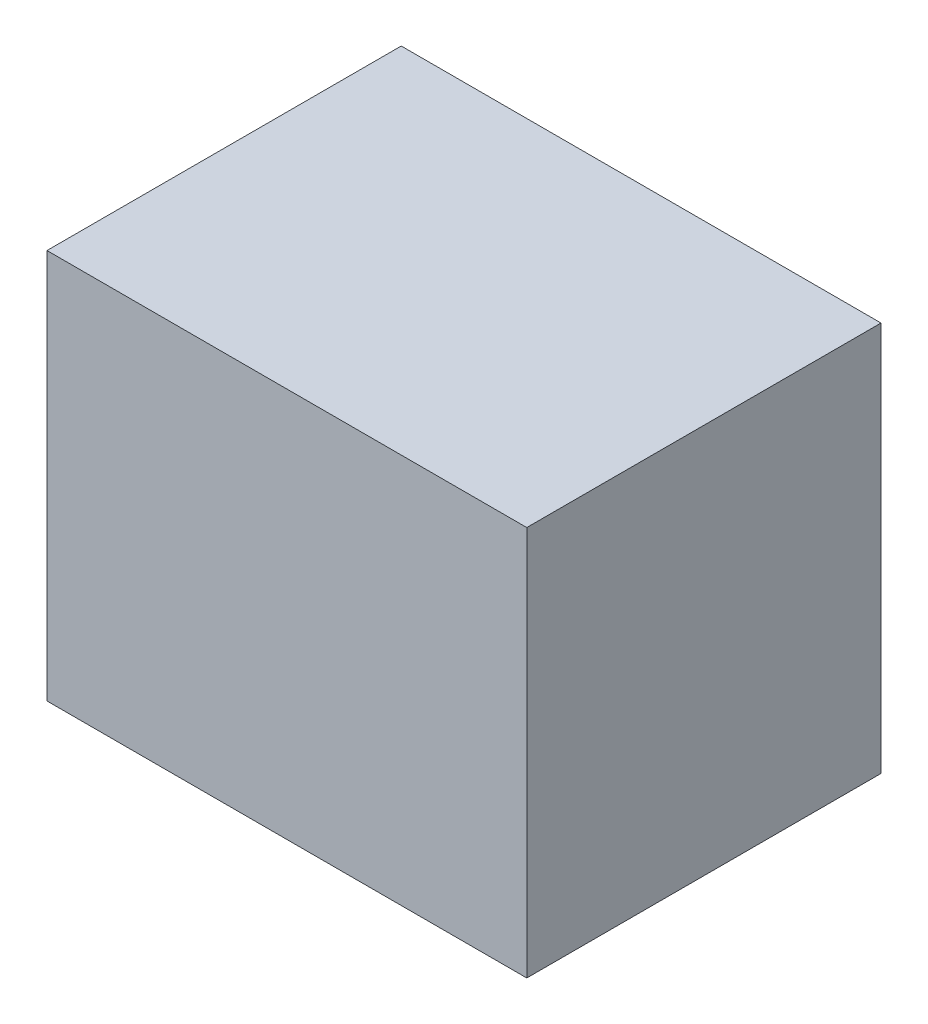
ISO-10303-21;
HEADER;
FILE_DESCRIPTION(('STEP AP214'),'2;1');
FILE_NAME('part.step','',(''),(''),'','','');
FILE_SCHEMA(('AUTOMOTIVE_DESIGN { 1 0 10303 214 1 1 1 1 }'));
ENDSEC;
DATA;
#1=APPLICATION_CONTEXT('core data for automotive mechanical design processes');
#2=APPLICATION_PROTOCOL_DEFINITION('international standard','automotive_design',2000,#1);
#3=PRODUCT_CONTEXT('',#1,'mechanical');
#4=PRODUCT('Part','Part','',(#3));
#5=PRODUCT_RELATED_PRODUCT_CATEGORY('part','',(#4));
#6=PRODUCT_DEFINITION_FORMATION('','',#4);
#7=PRODUCT_DEFINITION_CONTEXT('part definition',#1,'design');
#8=PRODUCT_DEFINITION('design','',#6,#7);
#9=PRODUCT_DEFINITION_SHAPE('','',#8);
#10=(LENGTH_UNIT() NAMED_UNIT(*) SI_UNIT(.MILLI.,.METRE.));
#11=(NAMED_UNIT(*) PLANE_ANGLE_UNIT() SI_UNIT($,.RADIAN.));
#12=(NAMED_UNIT(*) SI_UNIT($,.STERADIAN.) SOLID_ANGLE_UNIT());
#13=UNCERTAINTY_MEASURE_WITH_UNIT(LENGTH_MEASURE(1.E-05),#10,'distance_accuracy_value','');
#14=(GEOMETRIC_REPRESENTATION_CONTEXT(3) GLOBAL_UNCERTAINTY_ASSIGNED_CONTEXT((#13)) GLOBAL_UNIT_ASSIGNED_CONTEXT((#10,
#11,#12)) REPRESENTATION_CONTEXT('',''));
#15=CARTESIAN_POINT('',(0.,0.,0.));
#16=DIRECTION('',(0.,0.,1.));
#17=DIRECTION('',(1.,0.,0.));
#18=AXIS2_PLACEMENT_3D('',#15,#16,#17);
#19=CARTESIAN_POINT('',(53.5,-43.5,79.));
#20=DIRECTION('',(-1.,0.,0.));
#21=DIRECTION('',(0.,0.,1.));
#22=AXIS2_PLACEMENT_3D('',#19,#20,#21);
#23=PLANE('',#22);
#24=DIRECTION('',(0.,1.,0.));
#25=VECTOR('',#24,1.);
#26=CARTESIAN_POINT('',(53.5,-43.5,0.));
#27=LINE('',#26,#25);
#28=CARTESIAN_POINT('',(53.5,-43.5,0.));
#29=VERTEX_POINT('',#28);
#30=CARTESIAN_POINT('',(53.5,43.5,0.));
#31=VERTEX_POINT('',#30);
#32=EDGE_CURVE('E147',#29,#31,#27,.T.);
#33=ORIENTED_EDGE('',*,*,#32,.T.);
#34=DIRECTION('',(0.,0.,-1.));
#35=VECTOR('',#34,1.);
#36=CARTESIAN_POINT('',(53.5,43.5,79.));
#37=LINE('',#36,#35);
#38=CARTESIAN_POINT('',(53.5,43.5,79.));
#39=VERTEX_POINT('',#38);
#40=EDGE_CURVE('E11',#39,#31,#37,.T.);
#41=ORIENTED_EDGE('',*,*,#40,.F.);
#42=DIRECTION('',(0.,1.,0.));
#43=VECTOR('',#42,1.);
#44=CARTESIAN_POINT('',(53.5,-43.5,79.));
#45=LINE('',#44,#43);
#46=CARTESIAN_POINT('',(53.5,-43.5,79.));
#47=VERTEX_POINT('',#46);
#48=EDGE_CURVE('E158',#47,#39,#45,.T.);
#49=ORIENTED_EDGE('',*,*,#48,.F.);
#50=DIRECTION('',(0.,0.,-1.));
#51=VECTOR('',#50,1.);
#52=CARTESIAN_POINT('',(53.5,-43.5,79.));
#53=LINE('',#52,#51);
#54=EDGE_CURVE('E167',#47,#29,#53,.T.);
#55=ORIENTED_EDGE('',*,*,#54,.T.);
#56=EDGE_LOOP('',(#33,#41,#49,#55));
#57=FACE_BOUND('',#56,.T.);
#58=ADVANCED_FACE('F45',(#57),#23,.F.);
#59=CARTESIAN_POINT('',(-53.5,43.5,79.));
#60=DIRECTION('',(0.,-1.,0.));
#61=DIRECTION('',(0.,0.,-1.));
#62=AXIS2_PLACEMENT_3D('',#59,#60,#61);
#63=PLANE('',#62);
#64=DIRECTION('',(-1.,0.,0.));
#65=VECTOR('',#64,1.);
#66=CARTESIAN_POINT('',(-53.5,43.5,0.));
#67=LINE('',#66,#65);
#68=CARTESIAN_POINT('',(-53.5,43.5,0.));
#69=VERTEX_POINT('',#68);
#70=EDGE_CURVE('E152',#31,#69,#67,.T.);
#71=ORIENTED_EDGE('',*,*,#70,.T.);
#72=DIRECTION('',(0.,0.,-1.));
#73=VECTOR('',#72,1.);
#74=CARTESIAN_POINT('',(-53.5,43.5,79.));
#75=LINE('',#74,#73);
#76=CARTESIAN_POINT('',(-53.5,43.5,79.));
#77=VERTEX_POINT('',#76);
#78=EDGE_CURVE('E54',#77,#69,#75,.T.);
#79=ORIENTED_EDGE('',*,*,#78,.F.);
#80=DIRECTION('',(-1.,0.,0.));
#81=VECTOR('',#80,1.);
#82=CARTESIAN_POINT('',(-53.5,43.5,79.));
#83=LINE('',#82,#81);
#84=EDGE_CURVE('E99',#39,#77,#83,.T.);
#85=ORIENTED_EDGE('',*,*,#84,.F.);
#86=ORIENTED_EDGE('',*,*,#40,.T.);
#87=EDGE_LOOP('',(#71,#79,#85,#86));
#88=FACE_BOUND('',#87,.T.);
#89=ADVANCED_FACE('F224',(#88),#63,.F.);
#90=CARTESIAN_POINT('',(-53.5,-43.5,79.));
#91=DIRECTION('',(1.,0.,0.));
#92=DIRECTION('',(0.,0.,-1.));
#93=AXIS2_PLACEMENT_3D('',#90,#91,#92);
#94=PLANE('',#93);
#95=DIRECTION('',(0.,-1.,0.));
#96=VECTOR('',#95,1.);
#97=CARTESIAN_POINT('',(-53.5,-43.5,0.));
#98=LINE('',#97,#96);
#99=CARTESIAN_POINT('',(-53.5,-43.5,0.));
#100=VERTEX_POINT('',#99);
#101=EDGE_CURVE('E171',#69,#100,#98,.T.);
#102=ORIENTED_EDGE('',*,*,#101,.T.);
#103=DIRECTION('',(0.,0.,-1.));
#104=VECTOR('',#103,1.);
#105=CARTESIAN_POINT('',(-53.5,-43.5,79.));
#106=LINE('',#105,#104);
#107=CARTESIAN_POINT('',(-53.5,-43.5,79.));
#108=VERTEX_POINT('',#107);
#109=EDGE_CURVE('E178',#108,#100,#106,.T.);
#110=ORIENTED_EDGE('',*,*,#109,.F.);
#111=DIRECTION('',(0.,-1.,0.));
#112=VECTOR('',#111,1.);
#113=CARTESIAN_POINT('',(-53.5,-43.5,79.));
#114=LINE('',#113,#112);
#115=EDGE_CURVE('E163',#77,#108,#114,.T.);
#116=ORIENTED_EDGE('',*,*,#115,.F.);
#117=ORIENTED_EDGE('',*,*,#78,.T.);
#118=EDGE_LOOP('',(#102,#110,#116,#117));
#119=FACE_BOUND('',#118,.T.);
#120=ADVANCED_FACE('F229',(#119),#94,.F.);
#121=CARTESIAN_POINT('',(-53.5,-43.5,79.));
#122=DIRECTION('',(0.,1.,0.));
#123=DIRECTION('',(0.,0.,1.));
#124=AXIS2_PLACEMENT_3D('',#121,#122,#123);
#125=PLANE('',#124);
#126=DIRECTION('',(1.,0.,0.));
#127=VECTOR('',#126,1.);
#128=CARTESIAN_POINT('',(-53.5,-43.5,0.));
#129=LINE('',#128,#127);
#130=EDGE_CURVE('E92',#100,#29,#129,.T.);
#131=ORIENTED_EDGE('',*,*,#130,.T.);
#132=ORIENTED_EDGE('',*,*,#54,.F.);
#133=DIRECTION('',(1.,0.,0.));
#134=VECTOR('',#133,1.);
#135=CARTESIAN_POINT('',(-53.5,-43.5,79.));
#136=LINE('',#135,#134);
#137=EDGE_CURVE('E71',#108,#47,#136,.T.);
#138=ORIENTED_EDGE('',*,*,#137,.F.);
#139=ORIENTED_EDGE('',*,*,#109,.T.);
#140=EDGE_LOOP('',(#131,#132,#138,#139));
#141=FACE_BOUND('',#140,.T.);
#142=ADVANCED_FACE('F238',(#141),#125,.F.);
#143=CARTESIAN_POINT('',(0.,0.,79.));
#144=DIRECTION('',(0.,0.,-1.));
#145=DIRECTION('',(-1.,0.,0.));
#146=AXIS2_PLACEMENT_3D('',#143,#144,#145);
#147=PLANE('',#146);
#148=ORIENTED_EDGE('',*,*,#48,.T.);
#149=ORIENTED_EDGE('',*,*,#84,.T.);
#150=ORIENTED_EDGE('',*,*,#115,.T.);
#151=ORIENTED_EDGE('',*,*,#137,.T.);
#152=EDGE_LOOP('',(#148,#149,#150,#151));
#153=FACE_BOUND('',#152,.T.);
#154=ADVANCED_FACE('F203',(#153),#147,.F.);
#155=CARTESIAN_POINT('',(0.,0.,0.));
#156=DIRECTION('',(0.,0.,-1.));
#157=DIRECTION('',(-1.,0.,0.));
#158=AXIS2_PLACEMENT_3D('',#155,#156,#157);
#159=PLANE('',#158);
#160=CARTESIAN_POINT('',(-48.7,38.7,0.));
#161=DIRECTION('',(0.,0.,-1.));
#162=DIRECTION('',(-1.,0.,0.));
#163=AXIS2_PLACEMENT_3D('',#160,#161,#162);
#164=CIRCLE('',#163,1.5);
#165=CARTESIAN_POINT('',(-50.2,38.7,0.));
#166=VERTEX_POINT('',#165);
#167=EDGE_CURVE('E48',#166,#166,#164,.T.);
#168=ORIENTED_EDGE('',*,*,#167,.F.);
#169=EDGE_LOOP('',(#168));
#170=FACE_BOUND('',#169,.T.);
#171=CARTESIAN_POINT('',(-48.7,-38.5,0.));
#172=DIRECTION('',(0.,0.,-1.));
#173=DIRECTION('',(-1.,0.,0.));
#174=AXIS2_PLACEMENT_3D('',#171,#172,#173);
#175=CIRCLE('',#174,1.5);
#176=CARTESIAN_POINT('',(-50.2,-38.5,0.));
#177=VERTEX_POINT('',#176);
#178=EDGE_CURVE('E190',#177,#177,#175,.T.);
#179=ORIENTED_EDGE('',*,*,#178,.F.);
#180=EDGE_LOOP('',(#179));
#181=FACE_BOUND('',#180,.T.);
#182=CARTESIAN_POINT('',(48.5,38.7,0.));
#183=DIRECTION('',(0.,0.,-1.));
#184=DIRECTION('',(-1.,0.,0.));
#185=AXIS2_PLACEMENT_3D('',#182,#183,#184);
#186=CIRCLE('',#185,1.5);
#187=CARTESIAN_POINT('',(47.,38.7,0.));
#188=VERTEX_POINT('',#187);
#189=EDGE_CURVE('E187',#188,#188,#186,.T.);
#190=ORIENTED_EDGE('',*,*,#189,.F.);
#191=EDGE_LOOP('',(#190));
#192=FACE_BOUND('',#191,.T.);
#193=CARTESIAN_POINT('',(48.5,-38.5,0.));
#194=DIRECTION('',(0.,0.,-1.));
#195=DIRECTION('',(-1.,0.,0.));
#196=AXIS2_PLACEMENT_3D('',#193,#194,#195);
#197=CIRCLE('',#196,1.5);
#198=CARTESIAN_POINT('',(47.,-38.5,0.));
#199=VERTEX_POINT('',#198);
#200=EDGE_CURVE('E140',#199,#199,#197,.T.);
#201=ORIENTED_EDGE('',*,*,#200,.F.);
#202=EDGE_LOOP('',(#201));
#203=FACE_BOUND('',#202,.T.);
#204=DIRECTION('',(-1.,0.,0.));
#205=VECTOR('',#204,1.);
#206=CARTESIAN_POINT('',(-46.5,37.5,0.));
#207=LINE('',#206,#205);
#208=CARTESIAN_POINT('',(46.5,37.5,0.));
#209=VERTEX_POINT('',#208);
#210=CARTESIAN_POINT('',(-46.5,37.5,0.));
#211=VERTEX_POINT('',#210);
#212=EDGE_CURVE('E145',#209,#211,#207,.T.);
#213=ORIENTED_EDGE('',*,*,#212,.T.);
#214=DIRECTION('',(0.,-1.,0.));
#215=VECTOR('',#214,1.);
#216=CARTESIAN_POINT('',(-46.5,37.5,0.));
#217=LINE('',#216,#215);
#218=CARTESIAN_POINT('',(-46.5,-37.5,0.));
#219=VERTEX_POINT('',#218);
#220=EDGE_CURVE('E126',#211,#219,#217,.T.);
#221=ORIENTED_EDGE('',*,*,#220,.T.);
#222=DIRECTION('',(-1.,0.,0.));
#223=VECTOR('',#222,1.);
#224=CARTESIAN_POINT('',(-46.5,-37.5,0.));
#225=LINE('',#224,#223);
#226=CARTESIAN_POINT('',(46.5,-37.5,0.));
#227=VERTEX_POINT('',#226);
#228=EDGE_CURVE('E133',#227,#219,#225,.T.);
#229=ORIENTED_EDGE('',*,*,#228,.F.);
#230=DIRECTION('',(0.,-1.,0.));
#231=VECTOR('',#230,1.);
#232=CARTESIAN_POINT('',(46.5,37.5,0.));
#233=LINE('',#232,#231);
#234=EDGE_CURVE('E344',#209,#227,#233,.T.);
#235=ORIENTED_EDGE('',*,*,#234,.F.);
#236=EDGE_LOOP('',(#213,#221,#229,#235));
#237=FACE_BOUND('',#236,.T.);
#238=ORIENTED_EDGE('',*,*,#32,.F.);
#239=ORIENTED_EDGE('',*,*,#130,.F.);
#240=ORIENTED_EDGE('',*,*,#101,.F.);
#241=ORIENTED_EDGE('',*,*,#70,.F.);
#242=EDGE_LOOP('',(#238,#239,#240,#241));
#243=FACE_BOUND('',#242,.T.);
#244=ADVANCED_FACE('F142',(#170,#181,#192,#203,#237,#243),#159,.T.);
#245=CARTESIAN_POINT('',(-46.5,37.5,0.));
#246=DIRECTION('',(0.990268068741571,0.,-0.139173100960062));
#247=DIRECTION('',(-0.139173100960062,0.,-0.990268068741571));
#248=AXIS2_PLACEMENT_3D('',#245,#246,#247);
#249=PLANE('',#248);
#250=ORIENTED_EDGE('',*,*,#220,.F.);
#251=DIRECTION('',(0.139173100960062,0.,0.990268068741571));
#252=VECTOR('',#251,1.);
#253=CARTESIAN_POINT('',(-46.5,37.5,0.));
#254=LINE('',#253,#252);
#255=CARTESIAN_POINT('',(-36.3810599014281,37.5,72.));
#256=VERTEX_POINT('',#255);
#257=EDGE_CURVE('E341',#211,#256,#254,.T.);
#258=ORIENTED_EDGE('',*,*,#257,.T.);
#259=DIRECTION('',(0.,-1.,0.));
#260=VECTOR('',#259,1.);
#261=CARTESIAN_POINT('',(-36.3810599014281,37.5,72.));
#262=LINE('',#261,#260);
#263=CARTESIAN_POINT('',(-36.3810599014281,-37.5,72.));
#264=VERTEX_POINT('',#263);
#265=EDGE_CURVE('E129',#256,#264,#262,.T.);
#266=ORIENTED_EDGE('',*,*,#265,.T.);
#267=DIRECTION('',(0.139173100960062,0.,0.990268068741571));
#268=VECTOR('',#267,1.);
#269=CARTESIAN_POINT('',(-46.5,-37.5,0.));
#270=LINE('',#269,#268);
#271=EDGE_CURVE('E123',#219,#264,#270,.T.);
#272=ORIENTED_EDGE('',*,*,#271,.F.);
#273=EDGE_LOOP('',(#250,#258,#266,#272));
#274=FACE_BOUND('',#273,.T.);
#275=ADVANCED_FACE('F124',(#274),#249,.T.);
#276=CARTESIAN_POINT('',(-36.3810599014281,37.5,72.));
#277=DIRECTION('',(0.,0.,-1.));
#278=DIRECTION('',(-1.,0.,0.));
#279=AXIS2_PLACEMENT_3D('',#276,#277,#278);
#280=PLANE('',#279);
#281=ORIENTED_EDGE('',*,*,#265,.F.);
#282=DIRECTION('',(1.,0.,0.));
#283=VECTOR('',#282,1.);
#284=CARTESIAN_POINT('',(-36.3810599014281,37.5,72.));
#285=LINE('',#284,#283);
#286=CARTESIAN_POINT('',(36.3810599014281,37.5,72.));
#287=VERTEX_POINT('',#286);
#288=EDGE_CURVE('E349',#256,#287,#285,.T.);
#289=ORIENTED_EDGE('',*,*,#288,.T.);
#290=DIRECTION('',(0.,-1.,0.));
#291=VECTOR('',#290,1.);
#292=CARTESIAN_POINT('',(36.3810599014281,37.5,72.));
#293=LINE('',#292,#291);
#294=CARTESIAN_POINT('',(36.3810599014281,-37.5,72.));
#295=VERTEX_POINT('',#294);
#296=EDGE_CURVE('E154',#287,#295,#293,.T.);
#297=ORIENTED_EDGE('',*,*,#296,.T.);
#298=DIRECTION('',(1.,0.,0.));
#299=VECTOR('',#298,1.);
#300=CARTESIAN_POINT('',(-36.3810599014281,-37.5,72.));
#301=LINE('',#300,#299);
#302=EDGE_CURVE('E132',#264,#295,#301,.T.);
#303=ORIENTED_EDGE('',*,*,#302,.F.);
#304=EDGE_LOOP('',(#281,#289,#297,#303));
#305=FACE_BOUND('',#304,.T.);
#306=ADVANCED_FACE('F277',(#305),#280,.T.);
#307=CARTESIAN_POINT('',(36.3810599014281,37.5,72.));
#308=DIRECTION('',(-0.990268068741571,0.,-0.139173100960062));
#309=DIRECTION('',(-0.139173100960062,0.,0.990268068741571));
#310=AXIS2_PLACEMENT_3D('',#307,#308,#309);
#311=PLANE('',#310);
#312=ORIENTED_EDGE('',*,*,#296,.F.);
#313=DIRECTION('',(0.139173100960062,0.,-0.990268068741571));
#314=VECTOR('',#313,1.);
#315=CARTESIAN_POINT('',(36.3810599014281,37.5,72.));
#316=LINE('',#315,#314);
#317=EDGE_CURVE('E340',#287,#209,#316,.T.);
#318=ORIENTED_EDGE('',*,*,#317,.T.);
#319=ORIENTED_EDGE('',*,*,#234,.T.);
#320=DIRECTION('',(0.139173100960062,0.,-0.990268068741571));
#321=VECTOR('',#320,1.);
#322=CARTESIAN_POINT('',(36.3810599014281,-37.5,72.));
#323=LINE('',#322,#321);
#324=EDGE_CURVE('E62',#295,#227,#323,.T.);
#325=ORIENTED_EDGE('',*,*,#324,.F.);
#326=EDGE_LOOP('',(#312,#318,#319,#325));
#327=FACE_BOUND('',#326,.T.);
#328=ADVANCED_FACE('F285',(#327),#311,.T.);
#329=CARTESIAN_POINT('',(0.,37.5,0.));
#330=DIRECTION('',(0.,1.,0.));
#331=DIRECTION('',(0.,0.,1.));
#332=AXIS2_PLACEMENT_3D('',#329,#330,#331);
#333=PLANE('',#332);
#334=ORIENTED_EDGE('',*,*,#212,.F.);
#335=ORIENTED_EDGE('',*,*,#317,.F.);
#336=ORIENTED_EDGE('',*,*,#288,.F.);
#337=ORIENTED_EDGE('',*,*,#257,.F.);
#338=EDGE_LOOP('',(#334,#335,#336,#337));
#339=FACE_BOUND('',#338,.T.);
#340=ADVANCED_FACE('F221',(#339),#333,.F.);
#341=CARTESIAN_POINT('',(0.,-37.5,0.));
#342=DIRECTION('',(0.,1.,0.));
#343=DIRECTION('',(0.,0.,1.));
#344=AXIS2_PLACEMENT_3D('',#341,#342,#343);
#345=PLANE('',#344);
#346=ORIENTED_EDGE('',*,*,#228,.T.);
#347=ORIENTED_EDGE('',*,*,#271,.T.);
#348=ORIENTED_EDGE('',*,*,#302,.T.);
#349=ORIENTED_EDGE('',*,*,#324,.T.);
#350=EDGE_LOOP('',(#346,#347,#348,#349));
#351=FACE_BOUND('',#350,.T.);
#352=ADVANCED_FACE('F136',(#351),#345,.T.);
#353=CARTESIAN_POINT('',(48.5,-38.5,0.));
#354=DIRECTION('',(0.,0.,-1.));
#355=DIRECTION('',(-1.,0.,0.));
#356=AXIS2_PLACEMENT_3D('',#353,#354,#355);
#357=SPHERICAL_SURFACE('',#356,1.5);
#358=ORIENTED_EDGE('',*,*,#200,.T.);
#359=EDGE_LOOP('',(#358));
#360=FACE_BOUND('',#359,.T.);
#361=ADVANCED_FACE('F210',(#360),#357,.F.);
#362=CARTESIAN_POINT('',(48.5,38.7,0.));
#363=DIRECTION('',(0.,0.,-1.));
#364=DIRECTION('',(-1.,0.,0.));
#365=AXIS2_PLACEMENT_3D('',#362,#363,#364);
#366=SPHERICAL_SURFACE('',#365,1.5);
#367=ORIENTED_EDGE('',*,*,#189,.T.);
#368=EDGE_LOOP('',(#367));
#369=FACE_BOUND('',#368,.T.);
#370=ADVANCED_FACE('F212',(#369),#366,.F.);
#371=CARTESIAN_POINT('',(-48.7,-38.5,0.));
#372=DIRECTION('',(0.,0.,-1.));
#373=DIRECTION('',(-1.,0.,0.));
#374=AXIS2_PLACEMENT_3D('',#371,#372,#373);
#375=SPHERICAL_SURFACE('',#374,1.5);
#376=ORIENTED_EDGE('',*,*,#178,.T.);
#377=EDGE_LOOP('',(#376));
#378=FACE_BOUND('',#377,.T.);
#379=ADVANCED_FACE('F218',(#378),#375,.F.);
#380=CARTESIAN_POINT('',(-48.7,38.7,0.));
#381=DIRECTION('',(0.,0.,-1.));
#382=DIRECTION('',(-1.,0.,0.));
#383=AXIS2_PLACEMENT_3D('',#380,#381,#382);
#384=SPHERICAL_SURFACE('',#383,1.5);
#385=ORIENTED_EDGE('',*,*,#167,.T.);
#386=EDGE_LOOP('',(#385));
#387=FACE_BOUND('',#386,.T.);
#388=ADVANCED_FACE('F199',(#387),#384,.F.);
#389=CLOSED_SHELL('',(#58,#89,#120,#142,#154,#244,#275,#306,#328,#340,#352,#361,#370,#379,#388));
#390=MANIFOLD_SOLID_BREP('B2',#389);
#391=ADVANCED_BREP_SHAPE_REPRESENTATION('',(#18,#390),#14);
#392=SHAPE_DEFINITION_REPRESENTATION(#9,#391);
ENDSEC;
END-ISO-10303-21;
